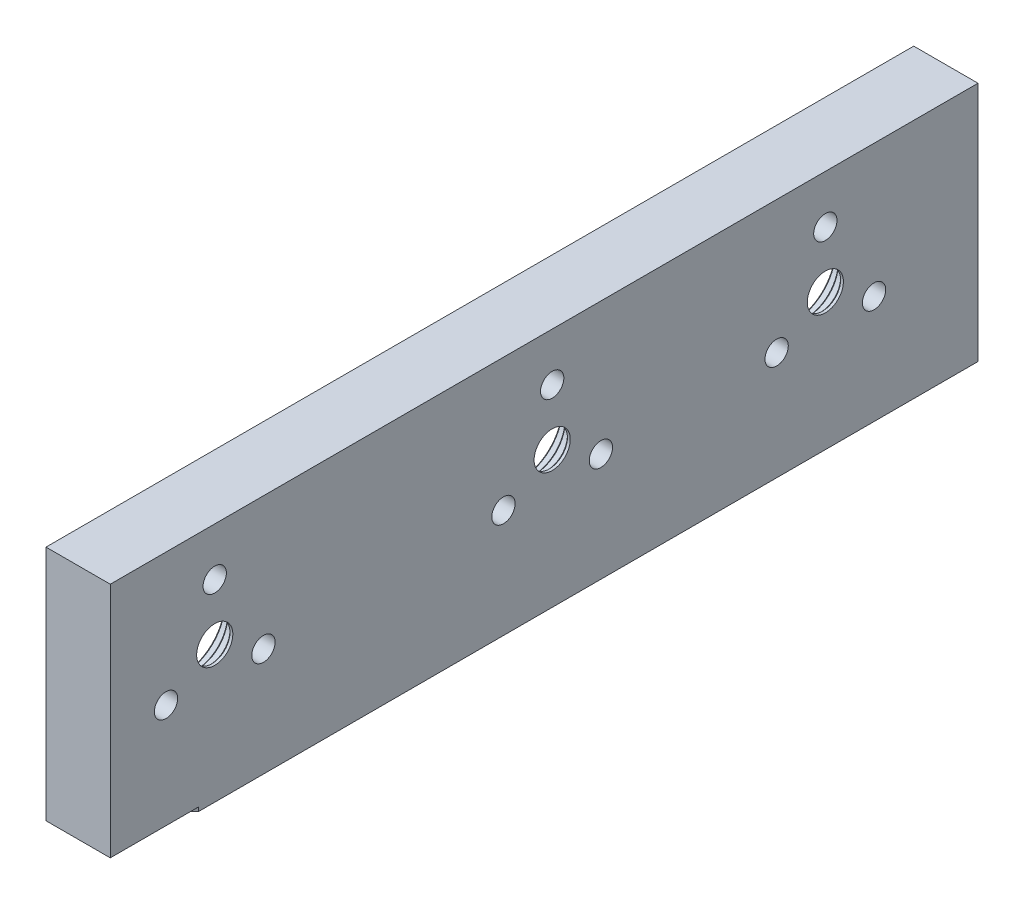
ISO-10303-21;
HEADER;
FILE_DESCRIPTION(('STEP AP214'),'2;1');
FILE_NAME('part.step','',(''),(''),'','','');
FILE_SCHEMA(('AUTOMOTIVE_DESIGN { 1 0 10303 214 1 1 1 1 }'));
ENDSEC;
DATA;
#1=APPLICATION_CONTEXT('core data for automotive mechanical design processes');
#2=APPLICATION_PROTOCOL_DEFINITION('international standard','automotive_design',2000,#1);
#3=PRODUCT_CONTEXT('',#1,'mechanical');
#4=PRODUCT('Part','Part','',(#3));
#5=PRODUCT_RELATED_PRODUCT_CATEGORY('part','',(#4));
#6=PRODUCT_DEFINITION_FORMATION('','',#4);
#7=PRODUCT_DEFINITION_CONTEXT('part definition',#1,'design');
#8=PRODUCT_DEFINITION('design','',#6,#7);
#9=PRODUCT_DEFINITION_SHAPE('','',#8);
#10=(LENGTH_UNIT() NAMED_UNIT(*) SI_UNIT(.MILLI.,.METRE.));
#11=(NAMED_UNIT(*) PLANE_ANGLE_UNIT() SI_UNIT($,.RADIAN.));
#12=(NAMED_UNIT(*) SI_UNIT($,.STERADIAN.) SOLID_ANGLE_UNIT());
#13=UNCERTAINTY_MEASURE_WITH_UNIT(LENGTH_MEASURE(1.E-05),#10,'distance_accuracy_value','');
#14=(GEOMETRIC_REPRESENTATION_CONTEXT(3) GLOBAL_UNCERTAINTY_ASSIGNED_CONTEXT((#13)) GLOBAL_UNIT_ASSIGNED_CONTEXT((#10,
#11,#12)) REPRESENTATION_CONTEXT('',''));
#15=CARTESIAN_POINT('',(0.,0.,0.));
#16=DIRECTION('',(0.,0.,1.));
#17=DIRECTION('',(1.,0.,0.));
#18=AXIS2_PLACEMENT_3D('',#15,#16,#17);
#19=CARTESIAN_POINT('',(-3.99999999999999,30.,55.));
#20=DIRECTION('',(0.,0.,-1.));
#21=DIRECTION('',(-1.,0.,0.));
#22=AXIS2_PLACEMENT_3D('',#19,#20,#21);
#23=PLANE('',#22);
#24=DIRECTION('',(-1.,0.,0.));
#25=VECTOR('',#24,1.);
#26=CARTESIAN_POINT('',(4.00000000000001,0.5,55.));
#27=LINE('',#26,#25);
#28=CARTESIAN_POINT('',(4.00000000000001,0.5,55.));
#29=VERTEX_POINT('',#28);
#30=CARTESIAN_POINT('',(-3.99999999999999,0.5,55.));
#31=VERTEX_POINT('',#30);
#32=EDGE_CURVE('E578',#29,#31,#27,.T.);
#33=ORIENTED_EDGE('',*,*,#32,.F.);
#34=DIRECTION('',(0.,-1.,0.));
#35=VECTOR('',#34,1.);
#36=CARTESIAN_POINT('',(4.00000000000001,30.,55.));
#37=LINE('',#36,#35);
#38=CARTESIAN_POINT('',(4.00000000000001,30.,55.));
#39=VERTEX_POINT('',#38);
#40=EDGE_CURVE('E577',#39,#29,#37,.T.);
#41=ORIENTED_EDGE('',*,*,#40,.F.);
#42=DIRECTION('',(1.,0.,0.));
#43=VECTOR('',#42,1.);
#44=CARTESIAN_POINT('',(-3.99999999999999,30.,55.));
#45=LINE('',#44,#43);
#46=CARTESIAN_POINT('',(-3.99999999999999,30.,55.));
#47=VERTEX_POINT('',#46);
#48=EDGE_CURVE('E509',#47,#39,#45,.T.);
#49=ORIENTED_EDGE('',*,*,#48,.F.);
#50=DIRECTION('',(0.,-1.,0.));
#51=VECTOR('',#50,1.);
#52=CARTESIAN_POINT('',(-3.99999999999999,30.,55.));
#53=LINE('',#52,#51);
#54=EDGE_CURVE('E716',#47,#31,#53,.T.);
#55=ORIENTED_EDGE('',*,*,#54,.T.);
#56=EDGE_LOOP('',(#33,#41,#49,#55));
#57=FACE_BOUND('',#56,.T.);
#58=ADVANCED_FACE('F484',(#57),#23,.F.);
#59=CARTESIAN_POINT('',(3.99999999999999,30.,-53.));
#60=DIRECTION('',(-1.,0.,0.));
#61=DIRECTION('',(0.,0.,1.));
#62=AXIS2_PLACEMENT_3D('',#59,#60,#61);
#63=PLANE('',#62);
#64=CARTESIAN_POINT('',(4.,24.,-34.));
#65=DIRECTION('',(1.,0.,0.));
#66=DIRECTION('',(0.,0.,-1.));
#67=AXIS2_PLACEMENT_3D('',#64,#65,#66);
#68=CIRCLE('',#67,1.44999999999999);
#69=CARTESIAN_POINT('',(4.,24.,-35.45));
#70=VERTEX_POINT('',#69);
#71=EDGE_CURVE('E609',#70,#70,#68,.T.);
#72=ORIENTED_EDGE('',*,*,#71,.F.);
#73=EDGE_LOOP('',(#72));
#74=FACE_BOUND('',#73,.T.);
#75=CARTESIAN_POINT('',(4.,13.5,-40.0621778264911));
#76=DIRECTION('',(1.,0.,0.));
#77=DIRECTION('',(0.,0.,-1.));
#78=AXIS2_PLACEMENT_3D('',#75,#76,#77);
#79=CIRCLE('',#78,1.44999999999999);
#80=CARTESIAN_POINT('',(4.,13.5,-41.5121778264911));
#81=VERTEX_POINT('',#80);
#82=EDGE_CURVE('E615',#81,#81,#79,.T.);
#83=ORIENTED_EDGE('',*,*,#82,.F.);
#84=EDGE_LOOP('',(#83));
#85=FACE_BOUND('',#84,.T.);
#86=CARTESIAN_POINT('',(4.,13.5,-27.9378221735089));
#87=DIRECTION('',(1.,0.,0.));
#88=DIRECTION('',(0.,0.,-1.));
#89=AXIS2_PLACEMENT_3D('',#86,#87,#88);
#90=CIRCLE('',#89,1.44999999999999);
#91=CARTESIAN_POINT('',(4.,13.5,-29.3878221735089));
#92=VERTEX_POINT('',#91);
#93=EDGE_CURVE('E621',#92,#92,#90,.T.);
#94=ORIENTED_EDGE('',*,*,#93,.F.);
#95=EDGE_LOOP('',(#94));
#96=FACE_BOUND('',#95,.T.);
#97=CARTESIAN_POINT('',(4.00000000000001,13.5,35.9378221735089));
#98=DIRECTION('',(1.,0.,0.));
#99=DIRECTION('',(0.,0.,-1.));
#100=AXIS2_PLACEMENT_3D('',#97,#98,#99);
#101=CIRCLE('',#100,1.44999999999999);
#102=CARTESIAN_POINT('',(4.00000000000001,13.5,34.4878221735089));
#103=VERTEX_POINT('',#102);
#104=EDGE_CURVE('E633',#103,#103,#101,.T.);
#105=ORIENTED_EDGE('',*,*,#104,.F.);
#106=EDGE_LOOP('',(#105));
#107=FACE_BOUND('',#106,.T.);
#108=CARTESIAN_POINT('',(4.00000000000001,13.5,48.0621778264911));
#109=DIRECTION('',(1.,0.,0.));
#110=DIRECTION('',(0.,0.,-1.));
#111=AXIS2_PLACEMENT_3D('',#108,#109,#110);
#112=CIRCLE('',#111,1.44999999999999);
#113=CARTESIAN_POINT('',(4.00000000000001,13.5,46.6121778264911));
#114=VERTEX_POINT('',#113);
#115=EDGE_CURVE('E639',#114,#114,#112,.T.);
#116=ORIENTED_EDGE('',*,*,#115,.F.);
#117=EDGE_LOOP('',(#116));
#118=FACE_BOUND('',#117,.T.);
#119=CARTESIAN_POINT('',(4.00000000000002,17.,-34.));
#120=DIRECTION('',(-1.,0.,0.));
#121=DIRECTION('',(0.,0.,1.));
#122=AXIS2_PLACEMENT_3D('',#119,#120,#121);
#123=CIRCLE('',#122,2.25);
#124=CARTESIAN_POINT('',(4.00000000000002,17.,-31.75));
#125=VERTEX_POINT('',#124);
#126=EDGE_CURVE('E645',#125,#125,#123,.T.);
#127=ORIENTED_EDGE('',*,*,#126,.T.);
#128=EDGE_LOOP('',(#127));
#129=FACE_BOUND('',#128,.T.);
#130=CARTESIAN_POINT('',(4.00000000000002,17.,42.));
#131=DIRECTION('',(-1.,0.,0.));
#132=DIRECTION('',(0.,0.,1.));
#133=AXIS2_PLACEMENT_3D('',#130,#131,#132);
#134=CIRCLE('',#133,2.25);
#135=CARTESIAN_POINT('',(4.00000000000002,17.,44.25));
#136=VERTEX_POINT('',#135);
#137=EDGE_CURVE('E648',#136,#136,#134,.T.);
#138=ORIENTED_EDGE('',*,*,#137,.T.);
#139=EDGE_LOOP('',(#138));
#140=FACE_BOUND('',#139,.T.);
#141=CARTESIAN_POINT('',(4.,24.,0.));
#142=DIRECTION('',(1.,0.,0.));
#143=DIRECTION('',(0.,0.,-1.));
#144=AXIS2_PLACEMENT_3D('',#141,#142,#143);
#145=CIRCLE('',#144,1.44999999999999);
#146=CARTESIAN_POINT('',(4.,24.,-1.44999999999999));
#147=VERTEX_POINT('',#146);
#148=EDGE_CURVE('E669',#147,#147,#145,.T.);
#149=ORIENTED_EDGE('',*,*,#148,.F.);
#150=EDGE_LOOP('',(#149));
#151=FACE_BOUND('',#150,.T.);
#152=CARTESIAN_POINT('',(4.,13.5,-6.06217782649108));
#153=DIRECTION('',(1.,0.,0.));
#154=DIRECTION('',(0.,0.,-1.));
#155=AXIS2_PLACEMENT_3D('',#152,#153,#154);
#156=CIRCLE('',#155,1.44999999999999);
#157=CARTESIAN_POINT('',(4.,13.5,-7.51217782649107));
#158=VERTEX_POINT('',#157);
#159=EDGE_CURVE('E675',#158,#158,#156,.T.);
#160=ORIENTED_EDGE('',*,*,#159,.F.);
#161=EDGE_LOOP('',(#160));
#162=FACE_BOUND('',#161,.T.);
#163=CARTESIAN_POINT('',(4.00000000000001,13.5,6.06217782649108));
#164=DIRECTION('',(1.,0.,0.));
#165=DIRECTION('',(0.,0.,-1.));
#166=AXIS2_PLACEMENT_3D('',#163,#164,#165);
#167=CIRCLE('',#166,1.44999999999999);
#168=CARTESIAN_POINT('',(4.00000000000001,13.5,4.61217782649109));
#169=VERTEX_POINT('',#168);
#170=EDGE_CURVE('E681',#169,#169,#167,.T.);
#171=ORIENTED_EDGE('',*,*,#170,.F.);
#172=EDGE_LOOP('',(#171));
#173=FACE_BOUND('',#172,.T.);
#174=DIRECTION('',(0.,0.,1.));
#175=VECTOR('',#174,1.);
#176=CARTESIAN_POINT('',(4.00000000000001,0.5,44.));
#177=LINE('',#176,#175);
#178=CARTESIAN_POINT('',(4.00000000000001,0.5,44.));
#179=VERTEX_POINT('',#178);
#180=EDGE_CURVE('E569',#179,#29,#177,.T.);
#181=ORIENTED_EDGE('',*,*,#180,.F.);
#182=DIRECTION('',(0.,-1.,0.));
#183=VECTOR('',#182,1.);
#184=CARTESIAN_POINT('',(4.00000000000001,0.5,44.));
#185=LINE('',#184,#183);
#186=CARTESIAN_POINT('',(4.00000000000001,0.,44.));
#187=VERTEX_POINT('',#186);
#188=EDGE_CURVE('E556',#179,#187,#185,.T.);
#189=ORIENTED_EDGE('',*,*,#188,.T.);
#190=DIRECTION('',(0.,0.,-1.));
#191=VECTOR('',#190,1.);
#192=CARTESIAN_POINT('',(3.99999999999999,0.,-53.));
#193=LINE('',#192,#191);
#194=CARTESIAN_POINT('',(3.99999999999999,0.,-53.));
#195=VERTEX_POINT('',#194);
#196=EDGE_CURVE('E701',#187,#195,#193,.T.);
#197=ORIENTED_EDGE('',*,*,#196,.T.);
#198=DIRECTION('',(0.,-1.,0.));
#199=VECTOR('',#198,1.);
#200=CARTESIAN_POINT('',(3.99999999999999,30.,-53.));
#201=LINE('',#200,#199);
#202=CARTESIAN_POINT('',(3.99999999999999,30.,-53.));
#203=VERTEX_POINT('',#202);
#204=EDGE_CURVE('E721',#203,#195,#201,.T.);
#205=ORIENTED_EDGE('',*,*,#204,.F.);
#206=DIRECTION('',(0.,0.,-1.));
#207=VECTOR('',#206,1.);
#208=CARTESIAN_POINT('',(3.99999999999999,30.,-53.));
#209=LINE('',#208,#207);
#210=EDGE_CURVE('E702',#39,#203,#209,.T.);
#211=ORIENTED_EDGE('',*,*,#210,.F.);
#212=ORIENTED_EDGE('',*,*,#40,.T.);
#213=EDGE_LOOP('',(#181,#189,#197,#205,#211,#212));
#214=FACE_BOUND('',#213,.T.);
#215=CARTESIAN_POINT('',(4.,17.,0.));
#216=DIRECTION('',(1.,0.,0.));
#217=DIRECTION('',(0.,0.,-1.));
#218=AXIS2_PLACEMENT_3D('',#215,#216,#217);
#219=CIRCLE('',#218,2.25);
#220=CARTESIAN_POINT('',(4.,17.,-2.25));
#221=VERTEX_POINT('',#220);
#222=EDGE_CURVE('E688',#221,#221,#219,.F.);
#223=ORIENTED_EDGE('',*,*,#222,.T.);
#224=EDGE_LOOP('',(#223));
#225=FACE_BOUND('',#224,.T.);
#226=CARTESIAN_POINT('',(4.00000000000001,24.,42.));
#227=DIRECTION('',(1.,0.,0.));
#228=DIRECTION('',(0.,0.,-1.));
#229=AXIS2_PLACEMENT_3D('',#226,#227,#228);
#230=CIRCLE('',#229,1.44999999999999);
#231=CARTESIAN_POINT('',(4.00000000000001,24.,40.55));
#232=VERTEX_POINT('',#231);
#233=EDGE_CURVE('E627',#232,#232,#230,.T.);
#234=ORIENTED_EDGE('',*,*,#233,.F.);
#235=EDGE_LOOP('',(#234));
#236=FACE_BOUND('',#235,.T.);
#237=ADVANCED_FACE('F574',(#74,#85,#96,#107,#118,#129,#140,#151,#162,#173,#214,#225,#236),#63,.F.);
#238=CARTESIAN_POINT('',(7.46660000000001,17.,0.));
#239=DIRECTION('',(-1.,0.,0.));
#240=DIRECTION('',(0.,0.,1.));
#241=AXIS2_PLACEMENT_3D('',#238,#239,#240);
#242=CYLINDRICAL_SURFACE('',#241,2.25);
#243=CARTESIAN_POINT('',(3.64999999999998,17.,0.));
#244=DIRECTION('',(-1.,0.,0.));
#245=DIRECTION('',(0.,0.,1.));
#246=AXIS2_PLACEMENT_3D('',#243,#244,#245);
#247=CIRCLE('',#246,2.25);
#248=CARTESIAN_POINT('',(3.64999999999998,17.,2.25));
#249=VERTEX_POINT('',#248);
#250=EDGE_CURVE('E780',#249,#249,#247,.T.);
#251=ORIENTED_EDGE('',*,*,#250,.T.);
#252=EDGE_LOOP('',(#251));
#253=FACE_BOUND('',#252,.T.);
#254=ORIENTED_EDGE('',*,*,#222,.F.);
#255=EDGE_LOOP('',(#254));
#256=FACE_BOUND('',#255,.T.);
#257=ADVANCED_FACE('F817',(#253,#256),#242,.F.);
#258=CARTESIAN_POINT('',(-4.00000000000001,30.,-53.));
#259=DIRECTION('',(0.,0.,1.));
#260=DIRECTION('',(1.,0.,0.));
#261=AXIS2_PLACEMENT_3D('',#258,#259,#260);
#262=PLANE('',#261);
#263=DIRECTION('',(-1.,0.,0.));
#264=VECTOR('',#263,1.);
#265=CARTESIAN_POINT('',(-4.00000000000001,0.,-53.));
#266=LINE('',#265,#264);
#267=CARTESIAN_POINT('',(-4.00000000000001,0.,-53.));
#268=VERTEX_POINT('',#267);
#269=EDGE_CURVE('E525',#195,#268,#266,.T.);
#270=ORIENTED_EDGE('',*,*,#269,.T.);
#271=DIRECTION('',(0.,-1.,0.));
#272=VECTOR('',#271,1.);
#273=CARTESIAN_POINT('',(-4.00000000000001,30.,-53.));
#274=LINE('',#273,#272);
#275=CARTESIAN_POINT('',(-4.00000000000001,30.,-53.));
#276=VERTEX_POINT('',#275);
#277=EDGE_CURVE('E719',#276,#268,#274,.T.);
#278=ORIENTED_EDGE('',*,*,#277,.F.);
#279=DIRECTION('',(-1.,0.,0.));
#280=VECTOR('',#279,1.);
#281=CARTESIAN_POINT('',(-4.00000000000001,30.,-53.));
#282=LINE('',#281,#280);
#283=EDGE_CURVE('E530',#203,#276,#282,.T.);
#284=ORIENTED_EDGE('',*,*,#283,.F.);
#285=ORIENTED_EDGE('',*,*,#204,.T.);
#286=EDGE_LOOP('',(#270,#278,#284,#285));
#287=FACE_BOUND('',#286,.T.);
#288=ADVANCED_FACE('F828',(#287),#262,.F.);
#289=CARTESIAN_POINT('',(-4.00000000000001,30.,-53.));
#290=DIRECTION('',(1.,0.,0.));
#291=DIRECTION('',(0.,0.,-1.));
#292=AXIS2_PLACEMENT_3D('',#289,#290,#291);
#293=PLANE('',#292);
#294=CARTESIAN_POINT('',(-3.99999999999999,17.,42.));
#295=DIRECTION('',(1.,0.,0.));
#296=DIRECTION('',(0.,0.,-1.));
#297=AXIS2_PLACEMENT_3D('',#294,#295,#296);
#298=CIRCLE('',#297,11.5);
#299=CARTESIAN_POINT('',(-3.99999999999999,17.,30.5));
#300=VERTEX_POINT('',#299);
#301=EDGE_CURVE('E753',#300,#300,#298,.T.);
#302=ORIENTED_EDGE('',*,*,#301,.T.);
#303=EDGE_LOOP('',(#302));
#304=FACE_BOUND('',#303,.T.);
#305=CARTESIAN_POINT('',(-4.,17.,-34.));
#306=DIRECTION('',(1.,0.,0.));
#307=DIRECTION('',(0.,0.,-1.));
#308=AXIS2_PLACEMENT_3D('',#305,#306,#307);
#309=CIRCLE('',#308,11.5);
#310=CARTESIAN_POINT('',(-4.00000000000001,17.,-45.5));
#311=VERTEX_POINT('',#310);
#312=EDGE_CURVE('E750',#311,#311,#309,.T.);
#313=ORIENTED_EDGE('',*,*,#312,.T.);
#314=EDGE_LOOP('',(#313));
#315=FACE_BOUND('',#314,.T.);
#316=CARTESIAN_POINT('',(-4.,17.,0.));
#317=DIRECTION('',(1.,0.,0.));
#318=DIRECTION('',(0.,0.,-1.));
#319=AXIS2_PLACEMENT_3D('',#316,#317,#318);
#320=CIRCLE('',#319,11.5);
#321=CARTESIAN_POINT('',(-4.,17.,-11.5));
#322=VERTEX_POINT('',#321);
#323=EDGE_CURVE('E747',#322,#322,#320,.T.);
#324=ORIENTED_EDGE('',*,*,#323,.T.);
#325=EDGE_LOOP('',(#324));
#326=FACE_BOUND('',#325,.T.);
#327=DIRECTION('',(0.,0.,1.));
#328=VECTOR('',#327,1.);
#329=CARTESIAN_POINT('',(-4.00000000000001,0.,-53.));
#330=LINE('',#329,#328);
#331=CARTESIAN_POINT('',(-3.99999999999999,0.,52.0000000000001));
#332=VERTEX_POINT('',#331);
#333=EDGE_CURVE('E704',#268,#332,#330,.T.);
#334=ORIENTED_EDGE('',*,*,#333,.T.);
#335=DIRECTION('',(0.,-1.,0.));
#336=VECTOR('',#335,1.);
#337=CARTESIAN_POINT('',(-4.00000000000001,0.5,52.0000000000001));
#338=LINE('',#337,#336);
#339=CARTESIAN_POINT('',(-4.00000000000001,0.5,52.0000000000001));
#340=VERTEX_POINT('',#339);
#341=EDGE_CURVE('E500',#340,#332,#338,.T.);
#342=ORIENTED_EDGE('',*,*,#341,.F.);
#343=DIRECTION('',(0.,0.,-1.));
#344=VECTOR('',#343,1.);
#345=CARTESIAN_POINT('',(-3.99999999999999,0.5,55.));
#346=LINE('',#345,#344);
#347=EDGE_CURVE('E565',#31,#340,#346,.T.);
#348=ORIENTED_EDGE('',*,*,#347,.F.);
#349=ORIENTED_EDGE('',*,*,#54,.F.);
#350=DIRECTION('',(0.,0.,1.));
#351=VECTOR('',#350,1.);
#352=CARTESIAN_POINT('',(-4.00000000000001,30.,-53.));
#353=LINE('',#352,#351);
#354=EDGE_CURVE('E706',#276,#47,#353,.T.);
#355=ORIENTED_EDGE('',*,*,#354,.F.);
#356=ORIENTED_EDGE('',*,*,#277,.T.);
#357=EDGE_LOOP('',(#334,#342,#348,#349,#355,#356));
#358=FACE_BOUND('',#357,.T.);
#359=ADVANCED_FACE('F824',(#304,#315,#326,#358),#293,.F.);
#360=CARTESIAN_POINT('',(0.,30.,0.));
#361=DIRECTION('',(0.,1.,0.));
#362=DIRECTION('',(0.,0.,1.));
#363=AXIS2_PLACEMENT_3D('',#360,#361,#362);
#364=PLANE('',#363);
#365=ORIENTED_EDGE('',*,*,#210,.T.);
#366=ORIENTED_EDGE('',*,*,#283,.T.);
#367=ORIENTED_EDGE('',*,*,#354,.T.);
#368=ORIENTED_EDGE('',*,*,#48,.T.);
#369=EDGE_LOOP('',(#365,#366,#367,#368));
#370=FACE_BOUND('',#369,.T.);
#371=ADVANCED_FACE('F827',(#370),#364,.T.);
#372=CARTESIAN_POINT('',(0.,0.,0.));
#373=DIRECTION('',(0.,1.,0.));
#374=DIRECTION('',(0.,0.,1.));
#375=AXIS2_PLACEMENT_3D('',#372,#373,#374);
#376=PLANE('',#375);
#377=CARTESIAN_POINT('',(0.,0.,-48.));
#378=DIRECTION('',(0.,-1.,0.));
#379=DIRECTION('',(0.,0.,-1.));
#380=AXIS2_PLACEMENT_3D('',#377,#378,#379);
#381=CIRCLE('',#380,1.02499999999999);
#382=CARTESIAN_POINT('',(0.,0.,-49.025));
#383=VERTEX_POINT('',#382);
#384=EDGE_CURVE('E584',#383,#383,#381,.T.);
#385=ORIENTED_EDGE('',*,*,#384,.F.);
#386=EDGE_LOOP('',(#385));
#387=FACE_BOUND('',#386,.T.);
#388=CARTESIAN_POINT('',(0.,0.,-17.));
#389=DIRECTION('',(0.,-1.,0.));
#390=DIRECTION('',(0.,0.,-1.));
#391=AXIS2_PLACEMENT_3D('',#388,#389,#390);
#392=CIRCLE('',#391,1.02499999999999);
#393=CARTESIAN_POINT('',(0.,0.,-18.025));
#394=VERTEX_POINT('',#393);
#395=EDGE_CURVE('E591',#394,#394,#392,.T.);
#396=ORIENTED_EDGE('',*,*,#395,.F.);
#397=EDGE_LOOP('',(#396));
#398=FACE_BOUND('',#397,.T.);
#399=CARTESIAN_POINT('',(0.,0.,14.));
#400=DIRECTION('',(0.,-1.,0.));
#401=DIRECTION('',(0.,0.,-1.));
#402=AXIS2_PLACEMENT_3D('',#399,#400,#401);
#403=CIRCLE('',#402,1.02499999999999);
#404=CARTESIAN_POINT('',(0.,0.,12.975));
#405=VERTEX_POINT('',#404);
#406=EDGE_CURVE('E597',#405,#405,#403,.T.);
#407=ORIENTED_EDGE('',*,*,#406,.F.);
#408=EDGE_LOOP('',(#407));
#409=FACE_BOUND('',#408,.T.);
#410=CARTESIAN_POINT('',(0.,0.,39.));
#411=DIRECTION('',(0.,-1.,0.));
#412=DIRECTION('',(0.,0.,-1.));
#413=AXIS2_PLACEMENT_3D('',#410,#411,#412);
#414=CIRCLE('',#413,1.02499999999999);
#415=CARTESIAN_POINT('',(0.,0.,37.975));
#416=VERTEX_POINT('',#415);
#417=EDGE_CURVE('E603',#416,#416,#414,.T.);
#418=ORIENTED_EDGE('',*,*,#417,.F.);
#419=EDGE_LOOP('',(#418));
#420=FACE_BOUND('',#419,.T.);
#421=ORIENTED_EDGE('',*,*,#196,.F.);
#422=DIRECTION('',(0.707106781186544,0.,-0.707106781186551));
#423=VECTOR('',#422,1.);
#424=CARTESIAN_POINT('',(-4.00000000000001,0.,52.0000000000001));
#425=LINE('',#424,#423);
#426=EDGE_CURVE('E561',#332,#187,#425,.T.);
#427=ORIENTED_EDGE('',*,*,#426,.F.);
#428=ORIENTED_EDGE('',*,*,#333,.F.);
#429=ORIENTED_EDGE('',*,*,#269,.F.);
#430=EDGE_LOOP('',(#421,#427,#428,#429));
#431=FACE_BOUND('',#430,.T.);
#432=ADVANCED_FACE('F822',(#387,#398,#409,#420,#431),#376,.F.);
#433=CARTESIAN_POINT('',(0.,17.,0.));
#434=DIRECTION('',(-1.,0.,0.));
#435=DIRECTION('',(0.,0.,1.));
#436=AXIS2_PLACEMENT_3D('',#433,#434,#435);
#437=CYLINDRICAL_SURFACE('',#436,11.25);
#438=CARTESIAN_POINT('',(-3.75000000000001,17.,0.));
#439=DIRECTION('',(1.,0.,0.));
#440=DIRECTION('',(0.,0.,-1.));
#441=AXIS2_PLACEMENT_3D('',#438,#439,#440);
#442=CIRCLE('',#441,11.25);
#443=CARTESIAN_POINT('',(-3.75000000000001,17.,-11.25));
#444=VERTEX_POINT('',#443);
#445=EDGE_CURVE('E777',#444,#444,#442,.F.);
#446=ORIENTED_EDGE('',*,*,#445,.T.);
#447=EDGE_LOOP('',(#446));
#448=FACE_BOUND('',#447,.T.);
#449=CARTESIAN_POINT('',(0.,17.,0.));
#450=DIRECTION('',(-1.,0.,0.));
#451=DIRECTION('',(0.,0.,1.));
#452=AXIS2_PLACEMENT_3D('',#449,#450,#451);
#453=CIRCLE('',#452,11.25);
#454=CARTESIAN_POINT('',(0.,17.,11.25));
#455=VERTEX_POINT('',#454);
#456=EDGE_CURVE('E697',#455,#455,#453,.T.);
#457=ORIENTED_EDGE('',*,*,#456,.F.);
#458=EDGE_LOOP('',(#457));
#459=FACE_BOUND('',#458,.T.);
#460=ADVANCED_FACE('F989',(#448,#459),#437,.F.);
#461=CARTESIAN_POINT('',(0.,17.,0.));
#462=DIRECTION('',(-1.,0.,0.));
#463=DIRECTION('',(0.,0.,1.));
#464=AXIS2_PLACEMENT_3D('',#461,#462,#463);
#465=PLANE('',#464);
#466=CARTESIAN_POINT('',(0.,17.,0.));
#467=DIRECTION('',(-1.,0.,0.));
#468=DIRECTION('',(0.,0.,1.));
#469=AXIS2_PLACEMENT_3D('',#466,#467,#468);
#470=CIRCLE('',#469,5.254);
#471=CARTESIAN_POINT('',(0.,17.,5.254));
#472=VERTEX_POINT('',#471);
#473=EDGE_CURVE('E12',#472,#472,#470,.F.);
#474=ORIENTED_EDGE('',*,*,#473,.T.);
#475=EDGE_LOOP('',(#474));
#476=FACE_BOUND('',#475,.T.);
#477=CARTESIAN_POINT('',(0.,24.,0.));
#478=DIRECTION('',(-1.,0.,0.));
#479=DIRECTION('',(0.,0.,1.));
#480=AXIS2_PLACEMENT_3D('',#477,#478,#479);
#481=CIRCLE('',#480,1.44999999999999);
#482=CARTESIAN_POINT('',(0.,24.,1.44999999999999));
#483=VERTEX_POINT('',#482);
#484=EDGE_CURVE('E672',#483,#483,#481,.T.);
#485=ORIENTED_EDGE('',*,*,#484,.F.);
#486=EDGE_LOOP('',(#485));
#487=FACE_BOUND('',#486,.T.);
#488=CARTESIAN_POINT('',(0.,13.5,-6.06217782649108));
#489=DIRECTION('',(-1.,0.,0.));
#490=DIRECTION('',(0.,0.,1.));
#491=AXIS2_PLACEMENT_3D('',#488,#489,#490);
#492=CIRCLE('',#491,1.44999999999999);
#493=CARTESIAN_POINT('',(0.,13.5,-4.61217782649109));
#494=VERTEX_POINT('',#493);
#495=EDGE_CURVE('E678',#494,#494,#492,.T.);
#496=ORIENTED_EDGE('',*,*,#495,.F.);
#497=EDGE_LOOP('',(#496));
#498=FACE_BOUND('',#497,.T.);
#499=CARTESIAN_POINT('',(0.,13.5,6.06217782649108));
#500=DIRECTION('',(-1.,0.,0.));
#501=DIRECTION('',(0.,0.,1.));
#502=AXIS2_PLACEMENT_3D('',#499,#500,#501);
#503=CIRCLE('',#502,1.44999999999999);
#504=CARTESIAN_POINT('',(0.,13.5,7.51217782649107));
#505=VERTEX_POINT('',#504);
#506=EDGE_CURVE('E685',#505,#505,#503,.T.);
#507=ORIENTED_EDGE('',*,*,#506,.F.);
#508=EDGE_LOOP('',(#507));
#509=FACE_BOUND('',#508,.T.);
#510=ORIENTED_EDGE('',*,*,#456,.T.);
#511=EDGE_LOOP('',(#510));
#512=FACE_BOUND('',#511,.T.);
#513=ADVANCED_FACE('F986',(#476,#487,#498,#509,#512),#465,.T.);
#514=CARTESIAN_POINT('',(1.6,17.,0.));
#515=DIRECTION('',(-1.,0.,0.));
#516=DIRECTION('',(0.,0.,1.));
#517=AXIS2_PLACEMENT_3D('',#514,#515,#516);
#518=CYLINDRICAL_SURFACE('',#517,5.004);
#519=CARTESIAN_POINT('',(0.250000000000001,17.,0.));
#520=DIRECTION('',(-1.,0.,0.));
#521=DIRECTION('',(0.,0.,1.));
#522=AXIS2_PLACEMENT_3D('',#519,#520,#521);
#523=CIRCLE('',#522,5.004);
#524=CARTESIAN_POINT('',(0.250000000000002,17.,5.004));
#525=VERTEX_POINT('',#524);
#526=EDGE_CURVE('E493',#525,#525,#523,.T.);
#527=ORIENTED_EDGE('',*,*,#526,.T.);
#528=EDGE_LOOP('',(#527));
#529=FACE_BOUND('',#528,.T.);
#530=CARTESIAN_POINT('',(1.6,17.,0.));
#531=DIRECTION('',(-1.,0.,0.));
#532=DIRECTION('',(0.,0.,1.));
#533=AXIS2_PLACEMENT_3D('',#530,#531,#532);
#534=CIRCLE('',#533,5.004);
#535=CARTESIAN_POINT('',(1.6,17.,5.004));
#536=VERTEX_POINT('',#535);
#537=EDGE_CURVE('E693',#536,#536,#534,.T.);
#538=ORIENTED_EDGE('',*,*,#537,.F.);
#539=EDGE_LOOP('',(#538));
#540=FACE_BOUND('',#539,.T.);
#541=ADVANCED_FACE('F799',(#529,#540),#518,.F.);
#542=CARTESIAN_POINT('',(1.6,17.,0.));
#543=DIRECTION('',(-1.,0.,0.));
#544=DIRECTION('',(0.,0.,1.));
#545=AXIS2_PLACEMENT_3D('',#542,#543,#544);
#546=PLANE('',#545);
#547=CARTESIAN_POINT('',(1.6,17.,0.));
#548=DIRECTION('',(-1.,0.,0.));
#549=DIRECTION('',(0.,0.,1.));
#550=AXIS2_PLACEMENT_3D('',#547,#548,#549);
#551=CIRCLE('',#550,3.99999999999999);
#552=CARTESIAN_POINT('',(1.6,17.,3.99999999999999));
#553=VERTEX_POINT('',#552);
#554=EDGE_CURVE('E792',#553,#553,#551,.F.);
#555=ORIENTED_EDGE('',*,*,#554,.T.);
#556=EDGE_LOOP('',(#555));
#557=FACE_BOUND('',#556,.T.);
#558=ORIENTED_EDGE('',*,*,#537,.T.);
#559=EDGE_LOOP('',(#558));
#560=FACE_BOUND('',#559,.T.);
#561=ADVANCED_FACE('F979',(#557,#560),#546,.T.);
#562=CARTESIAN_POINT('',(3.4,17.,0.));
#563=DIRECTION('',(-1.,0.,0.));
#564=DIRECTION('',(0.,0.,1.));
#565=AXIS2_PLACEMENT_3D('',#562,#563,#564);
#566=CYLINDRICAL_SURFACE('',#565,3.75);
#567=CARTESIAN_POINT('',(1.84999999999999,17.,0.));
#568=DIRECTION('',(-1.,0.,0.));
#569=DIRECTION('',(0.,0.,1.));
#570=AXIS2_PLACEMENT_3D('',#567,#568,#569);
#571=CIRCLE('',#570,3.75);
#572=CARTESIAN_POINT('',(1.84999999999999,17.,3.75));
#573=VERTEX_POINT('',#572);
#574=EDGE_CURVE('E788',#573,#573,#571,.T.);
#575=ORIENTED_EDGE('',*,*,#574,.T.);
#576=EDGE_LOOP('',(#575));
#577=FACE_BOUND('',#576,.T.);
#578=CARTESIAN_POINT('',(3.4,17.,0.));
#579=DIRECTION('',(-1.,0.,0.));
#580=DIRECTION('',(0.,0.,1.));
#581=AXIS2_PLACEMENT_3D('',#578,#579,#580);
#582=CIRCLE('',#581,3.75);
#583=CARTESIAN_POINT('',(3.4,17.,3.75));
#584=VERTEX_POINT('',#583);
#585=EDGE_CURVE('E689',#584,#584,#582,.T.);
#586=ORIENTED_EDGE('',*,*,#585,.F.);
#587=EDGE_LOOP('',(#586));
#588=FACE_BOUND('',#587,.T.);
#589=ADVANCED_FACE('F975',(#577,#588),#566,.F.);
#590=CARTESIAN_POINT('',(3.4,17.,0.));
#591=DIRECTION('',(-1.,0.,0.));
#592=DIRECTION('',(0.,0.,1.));
#593=AXIS2_PLACEMENT_3D('',#590,#591,#592);
#594=PLANE('',#593);
#595=CARTESIAN_POINT('',(3.4,17.,0.));
#596=DIRECTION('',(-1.,0.,0.));
#597=DIRECTION('',(0.,0.,1.));
#598=AXIS2_PLACEMENT_3D('',#595,#596,#597);
#599=CIRCLE('',#598,2.49999999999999);
#600=CARTESIAN_POINT('',(3.4,17.,2.49999999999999));
#601=VERTEX_POINT('',#600);
#602=EDGE_CURVE('E784',#601,#601,#599,.F.);
#603=ORIENTED_EDGE('',*,*,#602,.T.);
#604=EDGE_LOOP('',(#603));
#605=FACE_BOUND('',#604,.T.);
#606=ORIENTED_EDGE('',*,*,#585,.T.);
#607=EDGE_LOOP('',(#606));
#608=FACE_BOUND('',#607,.T.);
#609=ADVANCED_FACE('F970',(#605,#608),#594,.T.);
#610=CARTESIAN_POINT('',(4.,13.5,6.06217782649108));
#611=DIRECTION('',(1.,0.,0.));
#612=DIRECTION('',(0.,0.,-1.));
#613=AXIS2_PLACEMENT_3D('',#610,#611,#612);
#614=CYLINDRICAL_SURFACE('',#613,1.44999999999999);
#615=ORIENTED_EDGE('',*,*,#506,.T.);
#616=EDGE_LOOP('',(#615));
#617=FACE_BOUND('',#616,.T.);
#618=ORIENTED_EDGE('',*,*,#170,.T.);
#619=EDGE_LOOP('',(#618));
#620=FACE_BOUND('',#619,.T.);
#621=ADVANCED_FACE('F967',(#617,#620),#614,.F.);
#622=CARTESIAN_POINT('',(4.,13.5,-6.06217782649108));
#623=DIRECTION('',(1.,0.,0.));
#624=DIRECTION('',(0.,0.,-1.));
#625=AXIS2_PLACEMENT_3D('',#622,#623,#624);
#626=CYLINDRICAL_SURFACE('',#625,1.44999999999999);
#627=ORIENTED_EDGE('',*,*,#495,.T.);
#628=EDGE_LOOP('',(#627));
#629=FACE_BOUND('',#628,.T.);
#630=ORIENTED_EDGE('',*,*,#159,.T.);
#631=EDGE_LOOP('',(#630));
#632=FACE_BOUND('',#631,.T.);
#633=ADVANCED_FACE('F963',(#629,#632),#626,.F.);
#634=CARTESIAN_POINT('',(4.,24.,0.));
#635=DIRECTION('',(1.,0.,0.));
#636=DIRECTION('',(0.,0.,-1.));
#637=AXIS2_PLACEMENT_3D('',#634,#635,#636);
#638=CYLINDRICAL_SURFACE('',#637,1.44999999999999);
#639=ORIENTED_EDGE('',*,*,#484,.T.);
#640=EDGE_LOOP('',(#639));
#641=FACE_BOUND('',#640,.T.);
#642=ORIENTED_EDGE('',*,*,#148,.T.);
#643=EDGE_LOOP('',(#642));
#644=FACE_BOUND('',#643,.T.);
#645=ADVANCED_FACE('F959',(#641,#644),#638,.F.);
#646=CARTESIAN_POINT('',(0.,17.,42.));
#647=DIRECTION('',(-1.,0.,0.));
#648=DIRECTION('',(0.,0.,1.));
#649=AXIS2_PLACEMENT_3D('',#646,#647,#648);
#650=CYLINDRICAL_SURFACE('',#649,11.25);
#651=CARTESIAN_POINT('',(-3.75,17.,42.));
#652=DIRECTION('',(1.,0.,0.));
#653=DIRECTION('',(0.,0.,-1.));
#654=AXIS2_PLACEMENT_3D('',#651,#652,#653);
#655=CIRCLE('',#654,11.25);
#656=CARTESIAN_POINT('',(-3.75,17.,30.75));
#657=VERTEX_POINT('',#656);
#658=EDGE_CURVE('E744',#657,#657,#655,.F.);
#659=ORIENTED_EDGE('',*,*,#658,.T.);
#660=EDGE_LOOP('',(#659));
#661=FACE_BOUND('',#660,.T.);
#662=CARTESIAN_POINT('',(0.,17.,42.));
#663=DIRECTION('',(-1.,0.,0.));
#664=DIRECTION('',(0.,0.,1.));
#665=AXIS2_PLACEMENT_3D('',#662,#663,#664);
#666=CIRCLE('',#665,11.25);
#667=CARTESIAN_POINT('',(0.,17.,53.25));
#668=VERTEX_POINT('',#667);
#669=EDGE_CURVE('E666',#668,#668,#666,.T.);
#670=ORIENTED_EDGE('',*,*,#669,.F.);
#671=EDGE_LOOP('',(#670));
#672=FACE_BOUND('',#671,.T.);
#673=ADVANCED_FACE('F955',(#661,#672),#650,.F.);
#674=CARTESIAN_POINT('',(0.,17.,42.));
#675=DIRECTION('',(-1.,0.,0.));
#676=DIRECTION('',(0.,0.,1.));
#677=AXIS2_PLACEMENT_3D('',#674,#675,#676);
#678=PLANE('',#677);
#679=CARTESIAN_POINT('',(0.,17.,42.));
#680=DIRECTION('',(-1.,0.,0.));
#681=DIRECTION('',(0.,0.,1.));
#682=AXIS2_PLACEMENT_3D('',#679,#680,#681);
#683=CIRCLE('',#682,5.254);
#684=CARTESIAN_POINT('',(0.,17.,47.254));
#685=VERTEX_POINT('',#684);
#686=EDGE_CURVE('E741',#685,#685,#683,.F.);
#687=ORIENTED_EDGE('',*,*,#686,.T.);
#688=EDGE_LOOP('',(#687));
#689=FACE_BOUND('',#688,.T.);
#690=CARTESIAN_POINT('',(0.,24.,42.));
#691=DIRECTION('',(-1.,0.,0.));
#692=DIRECTION('',(0.,0.,1.));
#693=AXIS2_PLACEMENT_3D('',#690,#691,#692);
#694=CIRCLE('',#693,1.44999999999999);
#695=CARTESIAN_POINT('',(0.,24.,43.45));
#696=VERTEX_POINT('',#695);
#697=EDGE_CURVE('E630',#696,#696,#694,.T.);
#698=ORIENTED_EDGE('',*,*,#697,.F.);
#699=EDGE_LOOP('',(#698));
#700=FACE_BOUND('',#699,.T.);
#701=CARTESIAN_POINT('',(0.,13.5,35.9378221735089));
#702=DIRECTION('',(-1.,0.,0.));
#703=DIRECTION('',(0.,0.,1.));
#704=AXIS2_PLACEMENT_3D('',#701,#702,#703);
#705=CIRCLE('',#704,1.44999999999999);
#706=CARTESIAN_POINT('',(0.,13.5,37.3878221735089));
#707=VERTEX_POINT('',#706);
#708=EDGE_CURVE('E636',#707,#707,#705,.T.);
#709=ORIENTED_EDGE('',*,*,#708,.F.);
#710=EDGE_LOOP('',(#709));
#711=FACE_BOUND('',#710,.T.);
#712=CARTESIAN_POINT('',(0.,13.5,48.0621778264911));
#713=DIRECTION('',(-1.,0.,0.));
#714=DIRECTION('',(0.,0.,1.));
#715=AXIS2_PLACEMENT_3D('',#712,#713,#714);
#716=CIRCLE('',#715,1.44999999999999);
#717=CARTESIAN_POINT('',(0.,13.5,49.5121778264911));
#718=VERTEX_POINT('',#717);
#719=EDGE_CURVE('E642',#718,#718,#716,.T.);
#720=ORIENTED_EDGE('',*,*,#719,.F.);
#721=EDGE_LOOP('',(#720));
#722=FACE_BOUND('',#721,.T.);
#723=ORIENTED_EDGE('',*,*,#669,.T.);
#724=EDGE_LOOP('',(#723));
#725=FACE_BOUND('',#724,.T.);
#726=ADVANCED_FACE('F951',(#689,#700,#711,#722,#725),#678,.T.);
#727=CARTESIAN_POINT('',(0.,17.,-34.));
#728=DIRECTION('',(-1.,0.,0.));
#729=DIRECTION('',(0.,0.,1.));
#730=AXIS2_PLACEMENT_3D('',#727,#728,#729);
#731=CYLINDRICAL_SURFACE('',#730,11.25);
#732=CARTESIAN_POINT('',(-3.75000000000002,17.,-34.));
#733=DIRECTION('',(1.,0.,0.));
#734=DIRECTION('',(0.,0.,-1.));
#735=AXIS2_PLACEMENT_3D('',#732,#733,#734);
#736=CIRCLE('',#735,11.25);
#737=CARTESIAN_POINT('',(-3.75000000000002,17.,-45.25));
#738=VERTEX_POINT('',#737);
#739=EDGE_CURVE('E774',#738,#738,#736,.F.);
#740=ORIENTED_EDGE('',*,*,#739,.T.);
#741=EDGE_LOOP('',(#740));
#742=FACE_BOUND('',#741,.T.);
#743=CARTESIAN_POINT('',(0.,17.,-34.));
#744=DIRECTION('',(-1.,0.,0.));
#745=DIRECTION('',(0.,0.,1.));
#746=AXIS2_PLACEMENT_3D('',#743,#744,#745);
#747=CIRCLE('',#746,11.25);
#748=CARTESIAN_POINT('',(0.,17.,-22.75));
#749=VERTEX_POINT('',#748);
#750=EDGE_CURVE('E663',#749,#749,#747,.T.);
#751=ORIENTED_EDGE('',*,*,#750,.F.);
#752=EDGE_LOOP('',(#751));
#753=FACE_BOUND('',#752,.T.);
#754=ADVANCED_FACE('F947',(#742,#753),#731,.F.);
#755=CARTESIAN_POINT('',(0.,17.,-34.));
#756=DIRECTION('',(-1.,0.,0.));
#757=DIRECTION('',(0.,0.,1.));
#758=AXIS2_PLACEMENT_3D('',#755,#756,#757);
#759=PLANE('',#758);
#760=CARTESIAN_POINT('',(0.,17.,-34.));
#761=DIRECTION('',(-1.,0.,0.));
#762=DIRECTION('',(0.,0.,1.));
#763=AXIS2_PLACEMENT_3D('',#760,#761,#762);
#764=CIRCLE('',#763,5.254);
#765=CARTESIAN_POINT('',(0.,17.,-28.746));
#766=VERTEX_POINT('',#765);
#767=EDGE_CURVE('E771',#766,#766,#764,.F.);
#768=ORIENTED_EDGE('',*,*,#767,.T.);
#769=EDGE_LOOP('',(#768));
#770=FACE_BOUND('',#769,.T.);
#771=CARTESIAN_POINT('',(0.,24.,-34.));
#772=DIRECTION('',(-1.,0.,0.));
#773=DIRECTION('',(0.,0.,1.));
#774=AXIS2_PLACEMENT_3D('',#771,#772,#773);
#775=CIRCLE('',#774,1.44999999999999);
#776=CARTESIAN_POINT('',(0.,24.,-32.55));
#777=VERTEX_POINT('',#776);
#778=EDGE_CURVE('E612',#777,#777,#775,.T.);
#779=ORIENTED_EDGE('',*,*,#778,.F.);
#780=EDGE_LOOP('',(#779));
#781=FACE_BOUND('',#780,.T.);
#782=CARTESIAN_POINT('',(0.,13.5,-40.0621778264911));
#783=DIRECTION('',(-1.,0.,0.));
#784=DIRECTION('',(0.,0.,1.));
#785=AXIS2_PLACEMENT_3D('',#782,#783,#784);
#786=CIRCLE('',#785,1.44999999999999);
#787=CARTESIAN_POINT('',(0.,13.5,-38.6121778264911));
#788=VERTEX_POINT('',#787);
#789=EDGE_CURVE('E618',#788,#788,#786,.T.);
#790=ORIENTED_EDGE('',*,*,#789,.F.);
#791=EDGE_LOOP('',(#790));
#792=FACE_BOUND('',#791,.T.);
#793=CARTESIAN_POINT('',(0.,13.5,-27.9378221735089));
#794=DIRECTION('',(-1.,0.,0.));
#795=DIRECTION('',(0.,0.,1.));
#796=AXIS2_PLACEMENT_3D('',#793,#794,#795);
#797=CIRCLE('',#796,1.44999999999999);
#798=CARTESIAN_POINT('',(0.,13.5,-26.4878221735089));
#799=VERTEX_POINT('',#798);
#800=EDGE_CURVE('E624',#799,#799,#797,.T.);
#801=ORIENTED_EDGE('',*,*,#800,.F.);
#802=EDGE_LOOP('',(#801));
#803=FACE_BOUND('',#802,.T.);
#804=ORIENTED_EDGE('',*,*,#750,.T.);
#805=EDGE_LOOP('',(#804));
#806=FACE_BOUND('',#805,.T.);
#807=ADVANCED_FACE('F943',(#770,#781,#792,#803,#806),#759,.T.);
#808=CARTESIAN_POINT('',(1.60000000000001,17.,42.));
#809=DIRECTION('',(-1.,0.,0.));
#810=DIRECTION('',(0.,0.,1.));
#811=AXIS2_PLACEMENT_3D('',#808,#809,#810);
#812=CYLINDRICAL_SURFACE('',#811,5.004);
#813=CARTESIAN_POINT('',(0.250000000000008,17.,42.));
#814=DIRECTION('',(-1.,0.,0.));
#815=DIRECTION('',(0.,0.,1.));
#816=AXIS2_PLACEMENT_3D('',#813,#814,#815);
#817=CIRCLE('',#816,5.004);
#818=CARTESIAN_POINT('',(0.250000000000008,17.,47.004));
#819=VERTEX_POINT('',#818);
#820=EDGE_CURVE('E738',#819,#819,#817,.T.);
#821=ORIENTED_EDGE('',*,*,#820,.T.);
#822=EDGE_LOOP('',(#821));
#823=FACE_BOUND('',#822,.T.);
#824=CARTESIAN_POINT('',(1.60000000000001,17.,42.));
#825=DIRECTION('',(-1.,0.,0.));
#826=DIRECTION('',(0.,0.,1.));
#827=AXIS2_PLACEMENT_3D('',#824,#825,#826);
#828=CIRCLE('',#827,5.004);
#829=CARTESIAN_POINT('',(1.60000000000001,17.,47.004));
#830=VERTEX_POINT('',#829);
#831=EDGE_CURVE('E660',#830,#830,#828,.T.);
#832=ORIENTED_EDGE('',*,*,#831,.F.);
#833=EDGE_LOOP('',(#832));
#834=FACE_BOUND('',#833,.T.);
#835=ADVANCED_FACE('F939',(#823,#834),#812,.F.);
#836=CARTESIAN_POINT('',(1.60000000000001,17.,42.));
#837=DIRECTION('',(-1.,0.,0.));
#838=DIRECTION('',(0.,0.,1.));
#839=AXIS2_PLACEMENT_3D('',#836,#837,#838);
#840=PLANE('',#839);
#841=CARTESIAN_POINT('',(1.60000000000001,17.,42.));
#842=DIRECTION('',(-1.,0.,0.));
#843=DIRECTION('',(0.,0.,1.));
#844=AXIS2_PLACEMENT_3D('',#841,#842,#843);
#845=CIRCLE('',#844,4.00000000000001);
#846=CARTESIAN_POINT('',(1.60000000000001,17.,46.));
#847=VERTEX_POINT('',#846);
#848=EDGE_CURVE('E735',#847,#847,#845,.F.);
#849=ORIENTED_EDGE('',*,*,#848,.T.);
#850=EDGE_LOOP('',(#849));
#851=FACE_BOUND('',#850,.T.);
#852=ORIENTED_EDGE('',*,*,#831,.T.);
#853=EDGE_LOOP('',(#852));
#854=FACE_BOUND('',#853,.T.);
#855=ADVANCED_FACE('F935',(#851,#854),#840,.T.);
#856=CARTESIAN_POINT('',(1.59999999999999,17.,-34.));
#857=DIRECTION('',(-1.,0.,0.));
#858=DIRECTION('',(0.,0.,1.));
#859=AXIS2_PLACEMENT_3D('',#856,#857,#858);
#860=CYLINDRICAL_SURFACE('',#859,5.004);
#861=CARTESIAN_POINT('',(0.249999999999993,17.,-34.));
#862=DIRECTION('',(-1.,0.,0.));
#863=DIRECTION('',(0.,0.,1.));
#864=AXIS2_PLACEMENT_3D('',#861,#862,#863);
#865=CIRCLE('',#864,5.004);
#866=CARTESIAN_POINT('',(0.249999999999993,17.,-28.996));
#867=VERTEX_POINT('',#866);
#868=EDGE_CURVE('E768',#867,#867,#865,.T.);
#869=ORIENTED_EDGE('',*,*,#868,.T.);
#870=EDGE_LOOP('',(#869));
#871=FACE_BOUND('',#870,.T.);
#872=CARTESIAN_POINT('',(1.59999999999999,17.,-34.));
#873=DIRECTION('',(-1.,0.,0.));
#874=DIRECTION('',(0.,0.,1.));
#875=AXIS2_PLACEMENT_3D('',#872,#873,#874);
#876=CIRCLE('',#875,5.004);
#877=CARTESIAN_POINT('',(1.59999999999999,17.,-28.996));
#878=VERTEX_POINT('',#877);
#879=EDGE_CURVE('E657',#878,#878,#876,.T.);
#880=ORIENTED_EDGE('',*,*,#879,.F.);
#881=EDGE_LOOP('',(#880));
#882=FACE_BOUND('',#881,.T.);
#883=ADVANCED_FACE('F931',(#871,#882),#860,.F.);
#884=CARTESIAN_POINT('',(1.59999999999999,17.,-34.));
#885=DIRECTION('',(-1.,0.,0.));
#886=DIRECTION('',(0.,0.,1.));
#887=AXIS2_PLACEMENT_3D('',#884,#885,#886);
#888=PLANE('',#887);
#889=CARTESIAN_POINT('',(1.59999999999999,17.,-34.));
#890=DIRECTION('',(-1.,0.,0.));
#891=DIRECTION('',(0.,0.,1.));
#892=AXIS2_PLACEMENT_3D('',#889,#890,#891);
#893=CIRCLE('',#892,4.);
#894=CARTESIAN_POINT('',(1.59999999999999,17.,-30.));
#895=VERTEX_POINT('',#894);
#896=EDGE_CURVE('E765',#895,#895,#893,.F.);
#897=ORIENTED_EDGE('',*,*,#896,.T.);
#898=EDGE_LOOP('',(#897));
#899=FACE_BOUND('',#898,.T.);
#900=ORIENTED_EDGE('',*,*,#879,.T.);
#901=EDGE_LOOP('',(#900));
#902=FACE_BOUND('',#901,.T.);
#903=ADVANCED_FACE('F927',(#899,#902),#888,.T.);
#904=CARTESIAN_POINT('',(3.40000000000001,17.,42.));
#905=DIRECTION('',(-1.,0.,0.));
#906=DIRECTION('',(0.,0.,1.));
#907=AXIS2_PLACEMENT_3D('',#904,#905,#906);
#908=CYLINDRICAL_SURFACE('',#907,3.75);
#909=CARTESIAN_POINT('',(1.85000000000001,17.,42.));
#910=DIRECTION('',(-1.,0.,0.));
#911=DIRECTION('',(0.,0.,1.));
#912=AXIS2_PLACEMENT_3D('',#909,#910,#911);
#913=CIRCLE('',#912,3.75);
#914=CARTESIAN_POINT('',(1.85000000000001,17.,45.75));
#915=VERTEX_POINT('',#914);
#916=EDGE_CURVE('E732',#915,#915,#913,.T.);
#917=ORIENTED_EDGE('',*,*,#916,.T.);
#918=EDGE_LOOP('',(#917));
#919=FACE_BOUND('',#918,.T.);
#920=CARTESIAN_POINT('',(3.40000000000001,17.,42.));
#921=DIRECTION('',(-1.,0.,0.));
#922=DIRECTION('',(0.,0.,1.));
#923=AXIS2_PLACEMENT_3D('',#920,#921,#922);
#924=CIRCLE('',#923,3.75);
#925=CARTESIAN_POINT('',(3.40000000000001,17.,45.75));
#926=VERTEX_POINT('',#925);
#927=EDGE_CURVE('E654',#926,#926,#924,.T.);
#928=ORIENTED_EDGE('',*,*,#927,.F.);
#929=EDGE_LOOP('',(#928));
#930=FACE_BOUND('',#929,.T.);
#931=ADVANCED_FACE('F923',(#919,#930),#908,.F.);
#932=CARTESIAN_POINT('',(3.40000000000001,17.,42.));
#933=DIRECTION('',(-1.,0.,0.));
#934=DIRECTION('',(0.,0.,1.));
#935=AXIS2_PLACEMENT_3D('',#932,#933,#934);
#936=PLANE('',#935);
#937=CARTESIAN_POINT('',(3.40000000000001,17.,42.));
#938=DIRECTION('',(-1.,0.,0.));
#939=DIRECTION('',(0.,0.,1.));
#940=AXIS2_PLACEMENT_3D('',#937,#938,#939);
#941=CIRCLE('',#940,2.49999999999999);
#942=CARTESIAN_POINT('',(3.40000000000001,17.,44.5));
#943=VERTEX_POINT('',#942);
#944=EDGE_CURVE('E729',#943,#943,#941,.F.);
#945=ORIENTED_EDGE('',*,*,#944,.T.);
#946=EDGE_LOOP('',(#945));
#947=FACE_BOUND('',#946,.T.);
#948=ORIENTED_EDGE('',*,*,#927,.T.);
#949=EDGE_LOOP('',(#948));
#950=FACE_BOUND('',#949,.T.);
#951=ADVANCED_FACE('F919',(#947,#950),#936,.T.);
#952=CARTESIAN_POINT('',(3.39999999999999,17.,-34.));
#953=DIRECTION('',(-1.,0.,0.));
#954=DIRECTION('',(0.,0.,1.));
#955=AXIS2_PLACEMENT_3D('',#952,#953,#954);
#956=CYLINDRICAL_SURFACE('',#955,3.75);
#957=CARTESIAN_POINT('',(1.84999999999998,17.,-34.));
#958=DIRECTION('',(-1.,0.,0.));
#959=DIRECTION('',(0.,0.,1.));
#960=AXIS2_PLACEMENT_3D('',#957,#958,#959);
#961=CIRCLE('',#960,3.75);
#962=CARTESIAN_POINT('',(1.84999999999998,17.,-30.25));
#963=VERTEX_POINT('',#962);
#964=EDGE_CURVE('E762',#963,#963,#961,.T.);
#965=ORIENTED_EDGE('',*,*,#964,.T.);
#966=EDGE_LOOP('',(#965));
#967=FACE_BOUND('',#966,.T.);
#968=CARTESIAN_POINT('',(3.39999999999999,17.,-34.));
#969=DIRECTION('',(-1.,0.,0.));
#970=DIRECTION('',(0.,0.,1.));
#971=AXIS2_PLACEMENT_3D('',#968,#969,#970);
#972=CIRCLE('',#971,3.75);
#973=CARTESIAN_POINT('',(3.39999999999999,17.,-30.25));
#974=VERTEX_POINT('',#973);
#975=EDGE_CURVE('E651',#974,#974,#972,.T.);
#976=ORIENTED_EDGE('',*,*,#975,.F.);
#977=EDGE_LOOP('',(#976));
#978=FACE_BOUND('',#977,.T.);
#979=ADVANCED_FACE('F915',(#967,#978),#956,.F.);
#980=CARTESIAN_POINT('',(3.39999999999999,17.,-34.));
#981=DIRECTION('',(-1.,0.,0.));
#982=DIRECTION('',(0.,0.,1.));
#983=AXIS2_PLACEMENT_3D('',#980,#981,#982);
#984=PLANE('',#983);
#985=CARTESIAN_POINT('',(3.39999999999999,17.,-34.));
#986=DIRECTION('',(-1.,0.,0.));
#987=DIRECTION('',(0.,0.,1.));
#988=AXIS2_PLACEMENT_3D('',#985,#986,#987);
#989=CIRCLE('',#988,2.49999999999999);
#990=CARTESIAN_POINT('',(3.39999999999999,17.,-31.5));
#991=VERTEX_POINT('',#990);
#992=EDGE_CURVE('E759',#991,#991,#989,.F.);
#993=ORIENTED_EDGE('',*,*,#992,.T.);
#994=EDGE_LOOP('',(#993));
#995=FACE_BOUND('',#994,.T.);
#996=ORIENTED_EDGE('',*,*,#975,.T.);
#997=EDGE_LOOP('',(#996));
#998=FACE_BOUND('',#997,.T.);
#999=ADVANCED_FACE('F911',(#995,#998),#984,.T.);
#1000=CARTESIAN_POINT('',(4.00000000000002,17.,42.));
#1001=DIRECTION('',(-1.,0.,0.));
#1002=DIRECTION('',(0.,0.,1.));
#1003=AXIS2_PLACEMENT_3D('',#1000,#1001,#1002);
#1004=CYLINDRICAL_SURFACE('',#1003,2.25);
#1005=CARTESIAN_POINT('',(3.64999999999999,17.,42.));
#1006=DIRECTION('',(-1.,0.,0.));
#1007=DIRECTION('',(0.,0.,1.));
#1008=AXIS2_PLACEMENT_3D('',#1005,#1006,#1007);
#1009=CIRCLE('',#1008,2.25);
#1010=CARTESIAN_POINT('',(3.64999999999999,17.,44.25));
#1011=VERTEX_POINT('',#1010);
#1012=EDGE_CURVE('E723',#1011,#1011,#1009,.T.);
#1013=ORIENTED_EDGE('',*,*,#1012,.T.);
#1014=EDGE_LOOP('',(#1013));
#1015=FACE_BOUND('',#1014,.T.);
#1016=ORIENTED_EDGE('',*,*,#137,.F.);
#1017=EDGE_LOOP('',(#1016));
#1018=FACE_BOUND('',#1017,.T.);
#1019=ADVANCED_FACE('F907',(#1015,#1018),#1004,.F.);
#1020=CARTESIAN_POINT('',(4.00000000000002,17.,-34.));
#1021=DIRECTION('',(-1.,0.,0.));
#1022=DIRECTION('',(0.,0.,1.));
#1023=AXIS2_PLACEMENT_3D('',#1020,#1021,#1022);
#1024=CYLINDRICAL_SURFACE('',#1023,2.25);
#1025=CARTESIAN_POINT('',(3.64999999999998,17.,-34.));
#1026=DIRECTION('',(-1.,0.,0.));
#1027=DIRECTION('',(0.,0.,1.));
#1028=AXIS2_PLACEMENT_3D('',#1025,#1026,#1027);
#1029=CIRCLE('',#1028,2.25);
#1030=CARTESIAN_POINT('',(3.64999999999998,17.,-31.75));
#1031=VERTEX_POINT('',#1030);
#1032=EDGE_CURVE('E756',#1031,#1031,#1029,.T.);
#1033=ORIENTED_EDGE('',*,*,#1032,.T.);
#1034=EDGE_LOOP('',(#1033));
#1035=FACE_BOUND('',#1034,.T.);
#1036=ORIENTED_EDGE('',*,*,#126,.F.);
#1037=EDGE_LOOP('',(#1036));
#1038=FACE_BOUND('',#1037,.T.);
#1039=ADVANCED_FACE('F903',(#1035,#1038),#1024,.F.);
#1040=CARTESIAN_POINT('',(4.00000000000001,13.5,48.0621778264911));
#1041=DIRECTION('',(1.,0.,0.));
#1042=DIRECTION('',(0.,0.,-1.));
#1043=AXIS2_PLACEMENT_3D('',#1040,#1041,#1042);
#1044=CYLINDRICAL_SURFACE('',#1043,1.44999999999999);
#1045=ORIENTED_EDGE('',*,*,#719,.T.);
#1046=EDGE_LOOP('',(#1045));
#1047=FACE_BOUND('',#1046,.T.);
#1048=ORIENTED_EDGE('',*,*,#115,.T.);
#1049=EDGE_LOOP('',(#1048));
#1050=FACE_BOUND('',#1049,.T.);
#1051=ADVANCED_FACE('F896',(#1047,#1050),#1044,.F.);
#1052=CARTESIAN_POINT('',(4.00000000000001,13.5,35.9378221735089));
#1053=DIRECTION('',(1.,0.,0.));
#1054=DIRECTION('',(0.,0.,-1.));
#1055=AXIS2_PLACEMENT_3D('',#1052,#1053,#1054);
#1056=CYLINDRICAL_SURFACE('',#1055,1.44999999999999);
#1057=ORIENTED_EDGE('',*,*,#708,.T.);
#1058=EDGE_LOOP('',(#1057));
#1059=FACE_BOUND('',#1058,.T.);
#1060=ORIENTED_EDGE('',*,*,#104,.T.);
#1061=EDGE_LOOP('',(#1060));
#1062=FACE_BOUND('',#1061,.T.);
#1063=ADVANCED_FACE('F886',(#1059,#1062),#1056,.F.);
#1064=CARTESIAN_POINT('',(4.00000000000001,24.,42.));
#1065=DIRECTION('',(1.,0.,0.));
#1066=DIRECTION('',(0.,0.,-1.));
#1067=AXIS2_PLACEMENT_3D('',#1064,#1065,#1066);
#1068=CYLINDRICAL_SURFACE('',#1067,1.44999999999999);
#1069=ORIENTED_EDGE('',*,*,#697,.T.);
#1070=EDGE_LOOP('',(#1069));
#1071=FACE_BOUND('',#1070,.T.);
#1072=ORIENTED_EDGE('',*,*,#233,.T.);
#1073=EDGE_LOOP('',(#1072));
#1074=FACE_BOUND('',#1073,.T.);
#1075=ADVANCED_FACE('F883',(#1071,#1074),#1068,.F.);
#1076=CARTESIAN_POINT('',(4.,13.5,-27.9378221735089));
#1077=DIRECTION('',(1.,0.,0.));
#1078=DIRECTION('',(0.,0.,-1.));
#1079=AXIS2_PLACEMENT_3D('',#1076,#1077,#1078);
#1080=CYLINDRICAL_SURFACE('',#1079,1.44999999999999);
#1081=ORIENTED_EDGE('',*,*,#800,.T.);
#1082=EDGE_LOOP('',(#1081));
#1083=FACE_BOUND('',#1082,.T.);
#1084=ORIENTED_EDGE('',*,*,#93,.T.);
#1085=EDGE_LOOP('',(#1084));
#1086=FACE_BOUND('',#1085,.T.);
#1087=ADVANCED_FACE('F885',(#1083,#1086),#1080,.F.);
#1088=CARTESIAN_POINT('',(3.99999999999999,13.5,-40.0621778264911));
#1089=DIRECTION('',(1.,0.,0.));
#1090=DIRECTION('',(0.,0.,-1.));
#1091=AXIS2_PLACEMENT_3D('',#1088,#1089,#1090);
#1092=CYLINDRICAL_SURFACE('',#1091,1.44999999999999);
#1093=ORIENTED_EDGE('',*,*,#789,.T.);
#1094=EDGE_LOOP('',(#1093));
#1095=FACE_BOUND('',#1094,.T.);
#1096=ORIENTED_EDGE('',*,*,#82,.T.);
#1097=EDGE_LOOP('',(#1096));
#1098=FACE_BOUND('',#1097,.T.);
#1099=ADVANCED_FACE('F893',(#1095,#1098),#1092,.F.);
#1100=CARTESIAN_POINT('',(4.,24.,-34.));
#1101=DIRECTION('',(1.,0.,0.));
#1102=DIRECTION('',(0.,0.,-1.));
#1103=AXIS2_PLACEMENT_3D('',#1100,#1101,#1102);
#1104=CYLINDRICAL_SURFACE('',#1103,1.44999999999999);
#1105=ORIENTED_EDGE('',*,*,#778,.T.);
#1106=EDGE_LOOP('',(#1105));
#1107=FACE_BOUND('',#1106,.T.);
#1108=ORIENTED_EDGE('',*,*,#71,.T.);
#1109=EDGE_LOOP('',(#1108));
#1110=FACE_BOUND('',#1109,.T.);
#1111=ADVANCED_FACE('F1027',(#1107,#1110),#1104,.F.);
#1112=CARTESIAN_POINT('',(0.,5.,39.));
#1113=DIRECTION('',(0.,-1.,0.));
#1114=DIRECTION('',(0.,0.,-1.));
#1115=AXIS2_PLACEMENT_3D('',#1112,#1113,#1114);
#1116=CONICAL_SURFACE('',#1115,1.025,1.02974425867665);
#1117=CARTESIAN_POINT('',(0.,5.61588213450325,39.));
#1118=VERTEX_POINT('',#1117);
#1119=VERTEX_LOOP('',#1118);
#1120=FACE_BOUND('',#1119,.T.);
#1121=CARTESIAN_POINT('',(0.,5.,39.));
#1122=DIRECTION('',(0.,-1.,0.));
#1123=DIRECTION('',(0.,0.,-1.));
#1124=AXIS2_PLACEMENT_3D('',#1121,#1122,#1123);
#1125=CIRCLE('',#1124,1.025);
#1126=CARTESIAN_POINT('',(0.,5.,37.975));
#1127=VERTEX_POINT('',#1126);
#1128=EDGE_CURVE('E606',#1127,#1127,#1125,.T.);
#1129=ORIENTED_EDGE('',*,*,#1128,.T.);
#1130=EDGE_LOOP('',(#1129));
#1131=FACE_BOUND('',#1130,.T.);
#1132=ADVANCED_FACE('F1017',(#1120,#1131),#1116,.F.);
#1133=CARTESIAN_POINT('',(0.,0.,39.));
#1134=DIRECTION('',(0.,-1.,0.));
#1135=DIRECTION('',(0.,0.,-1.));
#1136=AXIS2_PLACEMENT_3D('',#1133,#1134,#1135);
#1137=CYLINDRICAL_SURFACE('',#1136,1.02499999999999);
#1138=ORIENTED_EDGE('',*,*,#1128,.F.);
#1139=EDGE_LOOP('',(#1138));
#1140=FACE_BOUND('',#1139,.T.);
#1141=ORIENTED_EDGE('',*,*,#417,.T.);
#1142=EDGE_LOOP('',(#1141));
#1143=FACE_BOUND('',#1142,.T.);
#1144=ADVANCED_FACE('F1014',(#1140,#1143),#1137,.F.);
#1145=CARTESIAN_POINT('',(0.,5.,14.));
#1146=DIRECTION('',(0.,-1.,0.));
#1147=DIRECTION('',(0.,0.,-1.));
#1148=AXIS2_PLACEMENT_3D('',#1145,#1146,#1147);
#1149=CONICAL_SURFACE('',#1148,1.025,1.02974425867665);
#1150=CARTESIAN_POINT('',(0.,5.61588213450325,14.));
#1151=VERTEX_POINT('',#1150);
#1152=VERTEX_LOOP('',#1151);
#1153=FACE_BOUND('',#1152,.T.);
#1154=CARTESIAN_POINT('',(0.,5.,14.));
#1155=DIRECTION('',(0.,-1.,0.));
#1156=DIRECTION('',(0.,0.,-1.));
#1157=AXIS2_PLACEMENT_3D('',#1154,#1155,#1156);
#1158=CIRCLE('',#1157,1.025);
#1159=CARTESIAN_POINT('',(0.,5.,12.975));
#1160=VERTEX_POINT('',#1159);
#1161=EDGE_CURVE('E600',#1160,#1160,#1158,.T.);
#1162=ORIENTED_EDGE('',*,*,#1161,.T.);
#1163=EDGE_LOOP('',(#1162));
#1164=FACE_BOUND('',#1163,.T.);
#1165=ADVANCED_FACE('F1016',(#1153,#1164),#1149,.F.);
#1166=CARTESIAN_POINT('',(0.,0.,14.));
#1167=DIRECTION('',(0.,-1.,0.));
#1168=DIRECTION('',(0.,0.,-1.));
#1169=AXIS2_PLACEMENT_3D('',#1166,#1167,#1168);
#1170=CYLINDRICAL_SURFACE('',#1169,1.02499999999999);
#1171=ORIENTED_EDGE('',*,*,#1161,.F.);
#1172=EDGE_LOOP('',(#1171));
#1173=FACE_BOUND('',#1172,.T.);
#1174=ORIENTED_EDGE('',*,*,#406,.T.);
#1175=EDGE_LOOP('',(#1174));
#1176=FACE_BOUND('',#1175,.T.);
#1177=ADVANCED_FACE('F1024',(#1173,#1176),#1170,.F.);
#1178=CARTESIAN_POINT('',(0.,5.,-17.));
#1179=DIRECTION('',(0.,-1.,0.));
#1180=DIRECTION('',(0.,0.,-1.));
#1181=AXIS2_PLACEMENT_3D('',#1178,#1179,#1180);
#1182=CONICAL_SURFACE('',#1181,1.025,1.02974425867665);
#1183=CARTESIAN_POINT('',(0.,5.61588213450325,-17.));
#1184=VERTEX_POINT('',#1183);
#1185=VERTEX_LOOP('',#1184);
#1186=FACE_BOUND('',#1185,.T.);
#1187=CARTESIAN_POINT('',(0.,5.,-17.));
#1188=DIRECTION('',(0.,-1.,0.));
#1189=DIRECTION('',(0.,0.,-1.));
#1190=AXIS2_PLACEMENT_3D('',#1187,#1188,#1189);
#1191=CIRCLE('',#1190,1.025);
#1192=CARTESIAN_POINT('',(0.,5.,-18.025));
#1193=VERTEX_POINT('',#1192);
#1194=EDGE_CURVE('E594',#1193,#1193,#1191,.T.);
#1195=ORIENTED_EDGE('',*,*,#1194,.T.);
#1196=EDGE_LOOP('',(#1195));
#1197=FACE_BOUND('',#1196,.T.);
#1198=ADVANCED_FACE('F1107',(#1186,#1197),#1182,.F.);
#1199=CARTESIAN_POINT('',(0.,0.,-17.));
#1200=DIRECTION('',(0.,-1.,0.));
#1201=DIRECTION('',(0.,0.,-1.));
#1202=AXIS2_PLACEMENT_3D('',#1199,#1200,#1201);
#1203=CYLINDRICAL_SURFACE('',#1202,1.02499999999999);
#1204=ORIENTED_EDGE('',*,*,#1194,.F.);
#1205=EDGE_LOOP('',(#1204));
#1206=FACE_BOUND('',#1205,.T.);
#1207=ORIENTED_EDGE('',*,*,#395,.T.);
#1208=EDGE_LOOP('',(#1207));
#1209=FACE_BOUND('',#1208,.T.);
#1210=ADVANCED_FACE('F1118',(#1206,#1209),#1203,.F.);
#1211=CARTESIAN_POINT('',(0.,5.,-48.));
#1212=DIRECTION('',(0.,-1.,0.));
#1213=DIRECTION('',(0.,0.,-1.));
#1214=AXIS2_PLACEMENT_3D('',#1211,#1212,#1213);
#1215=CONICAL_SURFACE('',#1214,1.025,1.02974425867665);
#1216=CARTESIAN_POINT('',(0.,5.61588213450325,-48.));
#1217=VERTEX_POINT('',#1216);
#1218=VERTEX_LOOP('',#1217);
#1219=FACE_BOUND('',#1218,.T.);
#1220=CARTESIAN_POINT('',(0.,5.,-48.));
#1221=DIRECTION('',(0.,-1.,0.));
#1222=DIRECTION('',(0.,0.,-1.));
#1223=AXIS2_PLACEMENT_3D('',#1220,#1221,#1222);
#1224=CIRCLE('',#1223,1.025);
#1225=CARTESIAN_POINT('',(0.,5.,-49.025));
#1226=VERTEX_POINT('',#1225);
#1227=EDGE_CURVE('E588',#1226,#1226,#1224,.T.);
#1228=ORIENTED_EDGE('',*,*,#1227,.T.);
#1229=EDGE_LOOP('',(#1228));
#1230=FACE_BOUND('',#1229,.T.);
#1231=ADVANCED_FACE('F1128',(#1219,#1230),#1215,.F.);
#1232=CARTESIAN_POINT('',(0.,0.,-48.));
#1233=DIRECTION('',(0.,-1.,0.));
#1234=DIRECTION('',(0.,0.,-1.));
#1235=AXIS2_PLACEMENT_3D('',#1232,#1233,#1234);
#1236=CYLINDRICAL_SURFACE('',#1235,1.02499999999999);
#1237=ORIENTED_EDGE('',*,*,#1227,.F.);
#1238=EDGE_LOOP('',(#1237));
#1239=FACE_BOUND('',#1238,.T.);
#1240=ORIENTED_EDGE('',*,*,#384,.T.);
#1241=EDGE_LOOP('',(#1240));
#1242=FACE_BOUND('',#1241,.T.);
#1243=ADVANCED_FACE('F1140',(#1239,#1242),#1236,.F.);
#1244=CARTESIAN_POINT('',(-4.00000000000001,0.5,52.0000000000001));
#1245=DIRECTION('',(-0.707106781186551,0.,-0.707106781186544));
#1246=DIRECTION('',(-0.707106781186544,0.,0.707106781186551));
#1247=AXIS2_PLACEMENT_3D('',#1244,#1245,#1246);
#1248=PLANE('',#1247);
#1249=ORIENTED_EDGE('',*,*,#426,.T.);
#1250=ORIENTED_EDGE('',*,*,#188,.F.);
#1251=DIRECTION('',(0.707106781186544,0.,-0.707106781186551));
#1252=VECTOR('',#1251,1.);
#1253=CARTESIAN_POINT('',(-4.00000000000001,0.5,52.0000000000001));
#1254=LINE('',#1253,#1252);
#1255=EDGE_CURVE('E559',#340,#179,#1254,.T.);
#1256=ORIENTED_EDGE('',*,*,#1255,.F.);
#1257=ORIENTED_EDGE('',*,*,#341,.T.);
#1258=EDGE_LOOP('',(#1249,#1250,#1256,#1257));
#1259=FACE_BOUND('',#1258,.T.);
#1260=ADVANCED_FACE('F558',(#1259),#1248,.F.);
#1261=CARTESIAN_POINT('',(0.,0.5,0.));
#1262=DIRECTION('',(0.,-1.,0.));
#1263=DIRECTION('',(0.,0.,-1.));
#1264=AXIS2_PLACEMENT_3D('',#1261,#1262,#1263);
#1265=PLANE('',#1264);
#1266=ORIENTED_EDGE('',*,*,#1255,.T.);
#1267=ORIENTED_EDGE('',*,*,#180,.T.);
#1268=ORIENTED_EDGE('',*,*,#32,.T.);
#1269=ORIENTED_EDGE('',*,*,#347,.T.);
#1270=EDGE_LOOP('',(#1266,#1267,#1268,#1269));
#1271=FACE_BOUND('',#1270,.T.);
#1272=ADVANCED_FACE('F568',(#1271),#1265,.T.);
#1273=CARTESIAN_POINT('',(3.64999999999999,17.,42.));
#1274=DIRECTION('',(-1.,0.,0.));
#1275=DIRECTION('',(0.,0.,1.));
#1276=AXIS2_PLACEMENT_3D('',#1273,#1274,#1275);
#1277=CONICAL_SURFACE('',#1276,2.25,0.78539816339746);
#1278=ORIENTED_EDGE('',*,*,#944,.F.);
#1279=EDGE_LOOP('',(#1278));
#1280=FACE_BOUND('',#1279,.T.);
#1281=ORIENTED_EDGE('',*,*,#1012,.F.);
#1282=EDGE_LOOP('',(#1281));
#1283=FACE_BOUND('',#1282,.T.);
#1284=ADVANCED_FACE('F832',(#1280,#1283),#1277,.F.);
#1285=CARTESIAN_POINT('',(1.85000000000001,17.,42.));
#1286=DIRECTION('',(-1.,0.,0.));
#1287=DIRECTION('',(0.,0.,1.));
#1288=AXIS2_PLACEMENT_3D('',#1285,#1286,#1287);
#1289=CONICAL_SURFACE('',#1288,3.75,0.785398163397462);
#1290=ORIENTED_EDGE('',*,*,#848,.F.);
#1291=EDGE_LOOP('',(#1290));
#1292=FACE_BOUND('',#1291,.T.);
#1293=ORIENTED_EDGE('',*,*,#916,.F.);
#1294=EDGE_LOOP('',(#1293));
#1295=FACE_BOUND('',#1294,.T.);
#1296=ADVANCED_FACE('F835',(#1292,#1295),#1289,.F.);
#1297=CARTESIAN_POINT('',(0.250000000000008,17.,42.));
#1298=DIRECTION('',(-1.,0.,0.));
#1299=DIRECTION('',(0.,0.,1.));
#1300=AXIS2_PLACEMENT_3D('',#1297,#1298,#1299);
#1301=CONICAL_SURFACE('',#1300,5.004,0.785398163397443);
#1302=ORIENTED_EDGE('',*,*,#686,.F.);
#1303=EDGE_LOOP('',(#1302));
#1304=FACE_BOUND('',#1303,.T.);
#1305=ORIENTED_EDGE('',*,*,#820,.F.);
#1306=EDGE_LOOP('',(#1305));
#1307=FACE_BOUND('',#1306,.T.);
#1308=ADVANCED_FACE('F839',(#1304,#1307),#1301,.F.);
#1309=CARTESIAN_POINT('',(-3.75,17.,42.));
#1310=DIRECTION('',(-1.,0.,0.));
#1311=DIRECTION('',(0.,0.,1.));
#1312=AXIS2_PLACEMENT_3D('',#1309,#1310,#1311);
#1313=CONICAL_SURFACE('',#1312,11.25,0.785398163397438);
#1314=ORIENTED_EDGE('',*,*,#301,.F.);
#1315=EDGE_LOOP('',(#1314));
#1316=FACE_BOUND('',#1315,.T.);
#1317=ORIENTED_EDGE('',*,*,#658,.F.);
#1318=EDGE_LOOP('',(#1317));
#1319=FACE_BOUND('',#1318,.T.);
#1320=ADVANCED_FACE('F843',(#1316,#1319),#1313,.F.);
#1321=CARTESIAN_POINT('',(3.64999999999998,17.,-34.));
#1322=DIRECTION('',(-1.,0.,0.));
#1323=DIRECTION('',(0.,0.,1.));
#1324=AXIS2_PLACEMENT_3D('',#1321,#1322,#1323);
#1325=CONICAL_SURFACE('',#1324,2.25,0.78539816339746);
#1326=ORIENTED_EDGE('',*,*,#992,.F.);
#1327=EDGE_LOOP('',(#1326));
#1328=FACE_BOUND('',#1327,.T.);
#1329=ORIENTED_EDGE('',*,*,#1032,.F.);
#1330=EDGE_LOOP('',(#1329));
#1331=FACE_BOUND('',#1330,.T.);
#1332=ADVANCED_FACE('F847',(#1328,#1331),#1325,.F.);
#1333=CARTESIAN_POINT('',(1.84999999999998,17.,-34.));
#1334=DIRECTION('',(-1.,0.,0.));
#1335=DIRECTION('',(0.,0.,1.));
#1336=AXIS2_PLACEMENT_3D('',#1333,#1334,#1335);
#1337=CONICAL_SURFACE('',#1336,3.75,0.785398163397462);
#1338=ORIENTED_EDGE('',*,*,#896,.F.);
#1339=EDGE_LOOP('',(#1338));
#1340=FACE_BOUND('',#1339,.T.);
#1341=ORIENTED_EDGE('',*,*,#964,.F.);
#1342=EDGE_LOOP('',(#1341));
#1343=FACE_BOUND('',#1342,.T.);
#1344=ADVANCED_FACE('F851',(#1340,#1343),#1337,.F.);
#1345=CARTESIAN_POINT('',(0.249999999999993,17.,-34.));
#1346=DIRECTION('',(-1.,0.,0.));
#1347=DIRECTION('',(0.,0.,1.));
#1348=AXIS2_PLACEMENT_3D('',#1345,#1346,#1347);
#1349=CONICAL_SURFACE('',#1348,5.004,0.785398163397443);
#1350=ORIENTED_EDGE('',*,*,#767,.F.);
#1351=EDGE_LOOP('',(#1350));
#1352=FACE_BOUND('',#1351,.T.);
#1353=ORIENTED_EDGE('',*,*,#868,.F.);
#1354=EDGE_LOOP('',(#1353));
#1355=FACE_BOUND('',#1354,.T.);
#1356=ADVANCED_FACE('F855',(#1352,#1355),#1349,.F.);
#1357=CARTESIAN_POINT('',(-3.75000000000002,17.,-34.));
#1358=DIRECTION('',(-1.,0.,0.));
#1359=DIRECTION('',(0.,0.,1.));
#1360=AXIS2_PLACEMENT_3D('',#1357,#1358,#1359);
#1361=CONICAL_SURFACE('',#1360,11.25,0.785398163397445);
#1362=ORIENTED_EDGE('',*,*,#312,.F.);
#1363=EDGE_LOOP('',(#1362));
#1364=FACE_BOUND('',#1363,.T.);
#1365=ORIENTED_EDGE('',*,*,#739,.F.);
#1366=EDGE_LOOP('',(#1365));
#1367=FACE_BOUND('',#1366,.T.);
#1368=ADVANCED_FACE('F859',(#1364,#1367),#1361,.F.);
#1369=CARTESIAN_POINT('',(-3.75000000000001,17.,0.));
#1370=DIRECTION('',(-1.,0.,0.));
#1371=DIRECTION('',(0.,0.,1.));
#1372=AXIS2_PLACEMENT_3D('',#1369,#1370,#1371);
#1373=CONICAL_SURFACE('',#1372,11.25,0.785398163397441);
#1374=ORIENTED_EDGE('',*,*,#323,.F.);
#1375=EDGE_LOOP('',(#1374));
#1376=FACE_BOUND('',#1375,.T.);
#1377=ORIENTED_EDGE('',*,*,#445,.F.);
#1378=EDGE_LOOP('',(#1377));
#1379=FACE_BOUND('',#1378,.T.);
#1380=ADVANCED_FACE('F863',(#1376,#1379),#1373,.F.);
#1381=CARTESIAN_POINT('',(3.64999999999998,17.,0.));
#1382=DIRECTION('',(-1.,0.,0.));
#1383=DIRECTION('',(0.,0.,1.));
#1384=AXIS2_PLACEMENT_3D('',#1381,#1382,#1383);
#1385=CONICAL_SURFACE('',#1384,2.25,0.78539816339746);
#1386=ORIENTED_EDGE('',*,*,#602,.F.);
#1387=EDGE_LOOP('',(#1386));
#1388=FACE_BOUND('',#1387,.T.);
#1389=ORIENTED_EDGE('',*,*,#250,.F.);
#1390=EDGE_LOOP('',(#1389));
#1391=FACE_BOUND('',#1390,.T.);
#1392=ADVANCED_FACE('F808',(#1388,#1391),#1385,.F.);
#1393=CARTESIAN_POINT('',(1.84999999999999,17.,0.));
#1394=DIRECTION('',(-1.,0.,0.));
#1395=DIRECTION('',(0.,0.,1.));
#1396=AXIS2_PLACEMENT_3D('',#1393,#1394,#1395);
#1397=CONICAL_SURFACE('',#1396,3.75,0.78539816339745);
#1398=ORIENTED_EDGE('',*,*,#554,.F.);
#1399=EDGE_LOOP('',(#1398));
#1400=FACE_BOUND('',#1399,.T.);
#1401=ORIENTED_EDGE('',*,*,#574,.F.);
#1402=EDGE_LOOP('',(#1401));
#1403=FACE_BOUND('',#1402,.T.);
#1404=ADVANCED_FACE('F803',(#1400,#1403),#1397,.F.);
#1405=CARTESIAN_POINT('',(0.25,17.,0.));
#1406=DIRECTION('',(-1.,0.,0.));
#1407=DIRECTION('',(0.,0.,1.));
#1408=AXIS2_PLACEMENT_3D('',#1405,#1406,#1407);
#1409=CONICAL_SURFACE('',#1408,5.004,0.785398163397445);
#1410=ORIENTED_EDGE('',*,*,#473,.F.);
#1411=EDGE_LOOP('',(#1410));
#1412=FACE_BOUND('',#1411,.T.);
#1413=ORIENTED_EDGE('',*,*,#526,.F.);
#1414=EDGE_LOOP('',(#1413));
#1415=FACE_BOUND('',#1414,.T.);
#1416=ADVANCED_FACE('F486',(#1412,#1415),#1409,.F.);
#1417=CLOSED_SHELL('',(#58,#237,#257,#288,#359,#371,#432,#460,#513,#541,#561,#589,#609,#621,
#633,#645,#673,#726,#754,#807,#835,#855,#883,#903,#931,#951,#979,#999,#1019,#1039,#1051,#1063,
#1075,#1087,#1099,#1111,#1132,#1144,#1165,#1177,#1198,#1210,#1231,#1243,#1260,#1272,#1284,#1296,
#1308,#1320,#1332,#1344,#1356,#1368,#1380,#1392,#1404,#1416));
#1418=MANIFOLD_SOLID_BREP('B2',#1417);
#1419=ADVANCED_BREP_SHAPE_REPRESENTATION('',(#18,#1418),#14);
#1420=SHAPE_DEFINITION_REPRESENTATION(#9,#1419);
ENDSEC;
END-ISO-10303-21;
